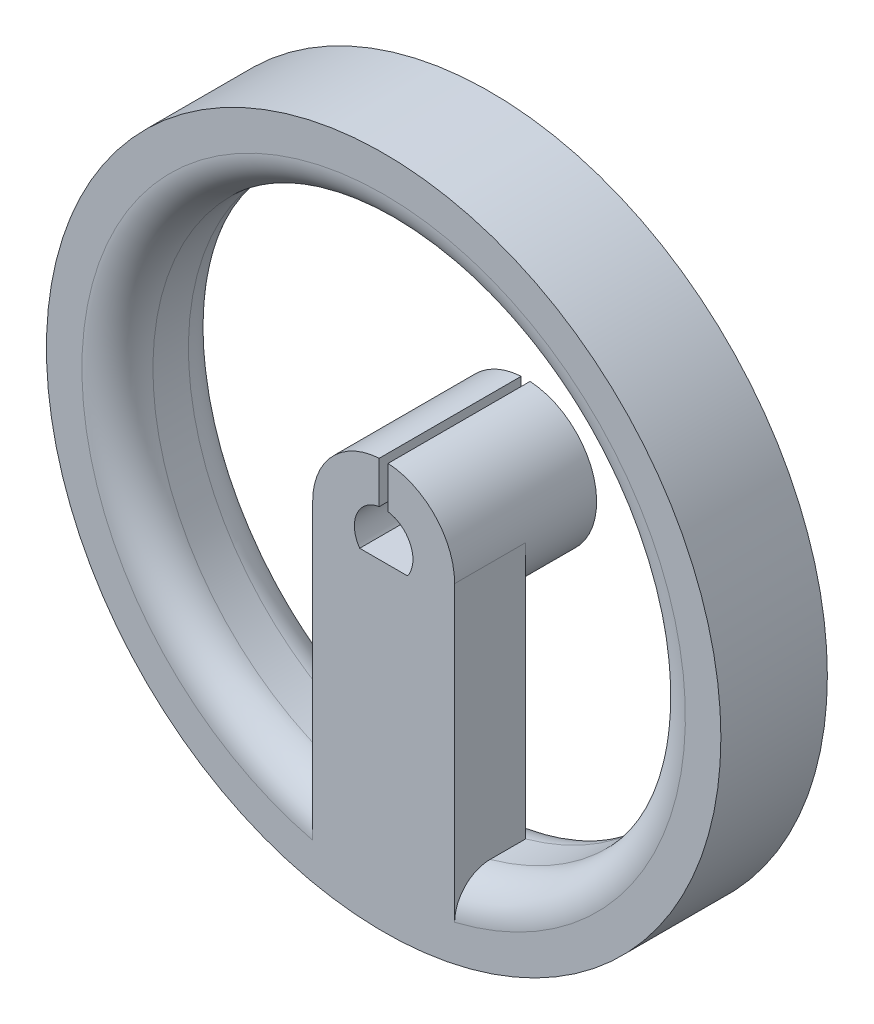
ISO-10303-21;
HEADER;
FILE_DESCRIPTION(('STEP AP214'),'2;1');
FILE_NAME('part.step','',(''),(''),'','','');
FILE_SCHEMA(('AUTOMOTIVE_DESIGN { 1 0 10303 214 1 1 1 1 }'));
ENDSEC;
DATA;
#1=APPLICATION_CONTEXT('core data for automotive mechanical design processes');
#2=APPLICATION_PROTOCOL_DEFINITION('international standard','automotive_design',2000,#1);
#3=PRODUCT_CONTEXT('',#1,'mechanical');
#4=PRODUCT('Part','Part','',(#3));
#5=PRODUCT_RELATED_PRODUCT_CATEGORY('part','',(#4));
#6=PRODUCT_DEFINITION_FORMATION('','',#4);
#7=PRODUCT_DEFINITION_CONTEXT('part definition',#1,'design');
#8=PRODUCT_DEFINITION('design','',#6,#7);
#9=PRODUCT_DEFINITION_SHAPE('','',#8);
#10=(LENGTH_UNIT() NAMED_UNIT(*) SI_UNIT(.MILLI.,.METRE.));
#11=(NAMED_UNIT(*) PLANE_ANGLE_UNIT() SI_UNIT($,.RADIAN.));
#12=(NAMED_UNIT(*) SI_UNIT($,.STERADIAN.) SOLID_ANGLE_UNIT());
#13=UNCERTAINTY_MEASURE_WITH_UNIT(LENGTH_MEASURE(1.E-05),#10,'distance_accuracy_value','');
#14=(GEOMETRIC_REPRESENTATION_CONTEXT(3) GLOBAL_UNCERTAINTY_ASSIGNED_CONTEXT((#13)) GLOBAL_UNIT_ASSIGNED_CONTEXT((#10,
#11,#12)) REPRESENTATION_CONTEXT('',''));
#15=CARTESIAN_POINT('',(0.,0.,0.));
#16=DIRECTION('',(0.,0.,1.));
#17=DIRECTION('',(1.,0.,0.));
#18=AXIS2_PLACEMENT_3D('',#15,#16,#17);
#19=CARTESIAN_POINT('',(0.,0.,-2.));
#20=DIRECTION('',(0.,0.,1.));
#21=DIRECTION('',(1.,0.,0.));
#22=AXIS2_PLACEMENT_3D('',#19,#20,#21);
#23=CYLINDRICAL_SURFACE('',#22,1.65);
#24=DIRECTION('',(0.,0.,1.));
#25=VECTOR('',#24,1.);
#26=CARTESIAN_POINT('',(0.25,1.63095064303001,-2.));
#27=LINE('',#26,#25);
#28=CARTESIAN_POINT('',(0.25,1.63095064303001,-2.));
#29=VERTEX_POINT('',#28);
#30=CARTESIAN_POINT('',(0.25,1.63095064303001,6.));
#31=VERTEX_POINT('',#30);
#32=EDGE_CURVE('E12',#29,#31,#27,.T.);
#33=ORIENTED_EDGE('',*,*,#32,.F.);
#34=CARTESIAN_POINT('',(0.,0.,-2.));
#35=DIRECTION('',(0.,0.,-1.));
#36=DIRECTION('',(1.,0.,0.));
#37=AXIS2_PLACEMENT_3D('',#34,#35,#36);
#38=CIRCLE('',#37,1.65);
#39=CARTESIAN_POINT('',(1.3490737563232,-0.95,-2.));
#40=VERTEX_POINT('',#39);
#41=EDGE_CURVE('E141',#29,#40,#38,.T.);
#42=ORIENTED_EDGE('',*,*,#41,.T.);
#43=DIRECTION('',(0.,0.,1.));
#44=VECTOR('',#43,1.);
#45=CARTESIAN_POINT('',(1.3490737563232,-0.95,-2.));
#46=LINE('',#45,#44);
#47=CARTESIAN_POINT('',(1.3490737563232,-0.95,6.));
#48=VERTEX_POINT('',#47);
#49=EDGE_CURVE('E149',#40,#48,#46,.T.);
#50=ORIENTED_EDGE('',*,*,#49,.T.);
#51=CARTESIAN_POINT('',(0.,0.,6.));
#52=DIRECTION('',(0.,0.,1.));
#53=DIRECTION('',(1.,0.,0.));
#54=AXIS2_PLACEMENT_3D('',#51,#52,#53);
#55=CIRCLE('',#54,1.65);
#56=EDGE_CURVE('E155',#31,#48,#55,.F.);
#57=ORIENTED_EDGE('',*,*,#56,.F.);
#58=EDGE_LOOP('',(#33,#42,#50,#57));
#59=FACE_BOUND('',#58,.T.);
#60=ADVANCED_FACE('F37',(#59),#23,.F.);
#61=CARTESIAN_POINT('',(0.,0.,6.));
#62=DIRECTION('',(0.,0.,1.));
#63=DIRECTION('',(1.,0.,0.));
#64=AXIS2_PLACEMENT_3D('',#61,#62,#63);
#65=PLANE('',#64);
#66=DIRECTION('',(0.,1.,0.));
#67=VECTOR('',#66,1.);
#68=CARTESIAN_POINT('',(0.250000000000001,0.,6.));
#69=LINE('',#68,#67);
#70=CARTESIAN_POINT('',(0.25,3.99217985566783,6.));
#71=VERTEX_POINT('',#70);
#72=EDGE_CURVE('E144',#31,#71,#69,.T.);
#73=ORIENTED_EDGE('',*,*,#72,.F.);
#74=ORIENTED_EDGE('',*,*,#56,.T.);
#75=DIRECTION('',(-1.,0.,0.));
#76=VECTOR('',#75,1.);
#77=CARTESIAN_POINT('',(0.,-0.95,6.));
#78=LINE('',#77,#76);
#79=CARTESIAN_POINT('',(-1.3490737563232,-0.95,6.));
#80=VERTEX_POINT('',#79);
#81=EDGE_CURVE('E152',#48,#80,#78,.T.);
#82=ORIENTED_EDGE('',*,*,#81,.T.);
#83=CARTESIAN_POINT('',(-0.25,1.63095064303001,6.));
#84=VERTEX_POINT('',#83);
#85=EDGE_CURVE('E156',#80,#84,#55,.F.);
#86=ORIENTED_EDGE('',*,*,#85,.T.);
#87=DIRECTION('',(0.,-1.,0.));
#88=VECTOR('',#87,1.);
#89=CARTESIAN_POINT('',(-0.250000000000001,0.,6.));
#90=LINE('',#89,#88);
#91=CARTESIAN_POINT('',(-0.25,3.99217985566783,6.));
#92=VERTEX_POINT('',#91);
#93=EDGE_CURVE('E53',#92,#84,#90,.T.);
#94=ORIENTED_EDGE('',*,*,#93,.F.);
#95=CARTESIAN_POINT('',(0.,0.,6.));
#96=DIRECTION('',(0.,0.,1.));
#97=DIRECTION('',(1.,0.,0.));
#98=AXIS2_PLACEMENT_3D('',#95,#96,#97);
#99=CIRCLE('',#98,4.);
#100=CARTESIAN_POINT('',(-4.,-7.21671059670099E-08,6.));
#101=VERTEX_POINT('',#100);
#102=EDGE_CURVE('E159',#92,#101,#99,.T.);
#103=ORIENTED_EDGE('',*,*,#102,.T.);
#104=DIRECTION('',(0.,-1.,0.));
#105=VECTOR('',#104,1.);
#106=CARTESIAN_POINT('',(-4.,-7.21671059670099E-08,6.));
#107=LINE('',#106,#105);
#108=CARTESIAN_POINT('',(-4.,-16.5227116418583,6.));
#109=VERTEX_POINT('',#108);
#110=EDGE_CURVE('E174',#101,#109,#107,.T.);
#111=ORIENTED_EDGE('',*,*,#110,.T.);
#112=CARTESIAN_POINT('',(0.,0.,6.));
#113=DIRECTION('',(0.,0.,1.));
#114=DIRECTION('',(1.,0.,0.));
#115=AXIS2_PLACEMENT_3D('',#112,#113,#114);
#116=CIRCLE('',#115,17.);
#117=CARTESIAN_POINT('',(4.,-16.5227116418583,6.));
#118=VERTEX_POINT('',#117);
#119=EDGE_CURVE('E203',#109,#118,#116,.F.);
#120=ORIENTED_EDGE('',*,*,#119,.T.);
#121=DIRECTION('',(0.,1.,0.));
#122=VECTOR('',#121,1.);
#123=CARTESIAN_POINT('',(4.,-14.456832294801,6.));
#124=LINE('',#123,#122);
#125=CARTESIAN_POINT('',(4.,-7.21671060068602E-08,6.));
#126=VERTEX_POINT('',#125);
#127=EDGE_CURVE('E164',#118,#126,#124,.T.);
#128=ORIENTED_EDGE('',*,*,#127,.T.);
#129=EDGE_CURVE('E171',#126,#71,#99,.T.);
#130=ORIENTED_EDGE('',*,*,#129,.T.);
#131=EDGE_LOOP('',(#73,#74,#82,#86,#94,#103,#111,#120,#128,#130));
#132=FACE_BOUND('',#131,.T.);
#133=CARTESIAN_POINT('',(0.,0.,6.));
#134=DIRECTION('',(0.,0.,1.));
#135=DIRECTION('',(1.,0.,0.));
#136=AXIS2_PLACEMENT_3D('',#133,#134,#135);
#137=CIRCLE('',#136,19.);
#138=CARTESIAN_POINT('',(19.,0.,6.));
#139=VERTEX_POINT('',#138);
#140=EDGE_CURVE('E189',#139,#139,#137,.T.);
#141=ORIENTED_EDGE('',*,*,#140,.T.);
#142=EDGE_LOOP('',(#141));
#143=FACE_BOUND('',#142,.T.);
#144=ADVANCED_FACE('F237',(#132,#143),#65,.T.);
#145=CARTESIAN_POINT('',(0.,0.,-2.));
#146=DIRECTION('',(0.,0.,1.));
#147=DIRECTION('',(1.,0.,0.));
#148=AXIS2_PLACEMENT_3D('',#145,#146,#147);
#149=PLANE('',#148);
#150=ORIENTED_EDGE('',*,*,#41,.F.);
#151=DIRECTION('',(0.,-1.,0.));
#152=VECTOR('',#151,1.);
#153=CARTESIAN_POINT('',(0.25,4.56774334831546,-2.));
#154=LINE('',#153,#152);
#155=CARTESIAN_POINT('',(0.25,3.99217985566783,-2.));
#156=VERTEX_POINT('',#155);
#157=EDGE_CURVE('E60',#156,#29,#154,.T.);
#158=ORIENTED_EDGE('',*,*,#157,.F.);
#159=CARTESIAN_POINT('',(0.,0.,-2.));
#160=DIRECTION('',(0.,0.,1.));
#161=DIRECTION('',(1.,0.,0.));
#162=AXIS2_PLACEMENT_3D('',#159,#160,#161);
#163=CIRCLE('',#162,4.00000000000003);
#164=CARTESIAN_POINT('',(-0.25,3.99217985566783,-2.));
#165=VERTEX_POINT('',#164);
#166=EDGE_CURVE('E134',#165,#156,#163,.T.);
#167=ORIENTED_EDGE('',*,*,#166,.F.);
#168=DIRECTION('',(0.,1.,0.));
#169=VECTOR('',#168,1.);
#170=CARTESIAN_POINT('',(-0.25,4.56774334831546,-2.));
#171=LINE('',#170,#169);
#172=CARTESIAN_POINT('',(-0.25,1.63095064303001,-2.));
#173=VERTEX_POINT('',#172);
#174=EDGE_CURVE('E119',#173,#165,#171,.T.);
#175=ORIENTED_EDGE('',*,*,#174,.F.);
#176=CARTESIAN_POINT('',(-1.3490737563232,-0.95,-2.));
#177=VERTEX_POINT('',#176);
#178=EDGE_CURVE('E132',#177,#173,#38,.T.);
#179=ORIENTED_EDGE('',*,*,#178,.F.);
#180=DIRECTION('',(-1.,0.,0.));
#181=VECTOR('',#180,1.);
#182=CARTESIAN_POINT('',(0.25,-0.95,-2.));
#183=LINE('',#182,#181);
#184=EDGE_CURVE('E140',#40,#177,#183,.T.);
#185=ORIENTED_EDGE('',*,*,#184,.F.);
#186=EDGE_LOOP('',(#150,#158,#167,#175,#179,#185));
#187=FACE_BOUND('',#186,.T.);
#188=ADVANCED_FACE('F130',(#187),#149,.F.);
#189=CARTESIAN_POINT('',(0.,0.,2.));
#190=DIRECTION('',(0.,0.,1.));
#191=DIRECTION('',(1.,0.,0.));
#192=AXIS2_PLACEMENT_3D('',#189,#190,#191);
#193=PLANE('',#192);
#194=CARTESIAN_POINT('',(0.,0.,2.));
#195=DIRECTION('',(0.,0.,1.));
#196=DIRECTION('',(1.,0.,0.));
#197=AXIS2_PLACEMENT_3D('',#194,#195,#196);
#198=CIRCLE('',#197,4.00000000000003);
#199=CARTESIAN_POINT('',(4.00000000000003,0.,2.));
#200=VERTEX_POINT('',#199);
#201=CARTESIAN_POINT('',(-4.,-7.21671059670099E-08,2.));
#202=VERTEX_POINT('',#201);
#203=EDGE_CURVE('E192',#200,#202,#198,.F.);
#204=ORIENTED_EDGE('',*,*,#203,.F.);
#205=DIRECTION('',(0.,1.,0.));
#206=VECTOR('',#205,1.);
#207=CARTESIAN_POINT('',(4.,-14.456832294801,2.));
#208=LINE('',#207,#206);
#209=CARTESIAN_POINT('',(4.,-14.456832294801,2.));
#210=VERTEX_POINT('',#209);
#211=EDGE_CURVE('E167',#210,#200,#208,.T.);
#212=ORIENTED_EDGE('',*,*,#211,.F.);
#213=CARTESIAN_POINT('',(0.,0.,2.));
#214=DIRECTION('',(0.,0.,1.));
#215=DIRECTION('',(-1.,0.,0.));
#216=AXIS2_PLACEMENT_3D('',#213,#214,#215);
#217=CIRCLE('',#216,15.);
#218=CARTESIAN_POINT('',(-4.,-14.456832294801,2.));
#219=VERTEX_POINT('',#218);
#220=EDGE_CURVE('E163',#219,#210,#217,.T.);
#221=ORIENTED_EDGE('',*,*,#220,.F.);
#222=DIRECTION('',(0.,-1.,0.));
#223=VECTOR('',#222,1.);
#224=CARTESIAN_POINT('',(-4.,-7.21671059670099E-08,2.));
#225=LINE('',#224,#223);
#226=EDGE_CURVE('E160',#202,#219,#225,.T.);
#227=ORIENTED_EDGE('',*,*,#226,.F.);
#228=EDGE_LOOP('',(#204,#212,#221,#227));
#229=FACE_BOUND('',#228,.T.);
#230=ADVANCED_FACE('F223',(#229),#193,.F.);
#231=CARTESIAN_POINT('',(0.,0.,6.));
#232=DIRECTION('',(0.,0.,-1.));
#233=DIRECTION('',(-1.,0.,0.));
#234=AXIS2_PLACEMENT_3D('',#231,#232,#233);
#235=CYLINDRICAL_SURFACE('',#234,19.);
#236=ORIENTED_EDGE('',*,*,#140,.F.);
#237=EDGE_LOOP('',(#236));
#238=FACE_BOUND('',#237,.T.);
#239=CARTESIAN_POINT('',(0.,0.,0.));
#240=DIRECTION('',(0.,0.,1.));
#241=DIRECTION('',(1.,0.,0.));
#242=AXIS2_PLACEMENT_3D('',#239,#240,#241);
#243=CIRCLE('',#242,19.);
#244=CARTESIAN_POINT('',(19.,0.,0.));
#245=VERTEX_POINT('',#244);
#246=EDGE_CURVE('E180',#245,#245,#243,.T.);
#247=ORIENTED_EDGE('',*,*,#246,.T.);
#248=EDGE_LOOP('',(#247));
#249=FACE_BOUND('',#248,.T.);
#250=ADVANCED_FACE('F243',(#238,#249),#235,.T.);
#251=CARTESIAN_POINT('',(0.,0.,0.));
#252=DIRECTION('',(0.,0.,1.));
#253=DIRECTION('',(1.,0.,0.));
#254=AXIS2_PLACEMENT_3D('',#251,#252,#253);
#255=PLANE('',#254);
#256=CARTESIAN_POINT('',(0.,0.,0.));
#257=DIRECTION('',(0.,0.,1.));
#258=DIRECTION('',(1.,0.,0.));
#259=AXIS2_PLACEMENT_3D('',#256,#257,#258);
#260=CIRCLE('',#259,17.);
#261=CARTESIAN_POINT('',(17.,0.,0.));
#262=VERTEX_POINT('',#261);
#263=EDGE_CURVE('E200',#262,#262,#260,.T.);
#264=ORIENTED_EDGE('',*,*,#263,.T.);
#265=EDGE_LOOP('',(#264));
#266=FACE_BOUND('',#265,.T.);
#267=ORIENTED_EDGE('',*,*,#246,.F.);
#268=EDGE_LOOP('',(#267));
#269=FACE_BOUND('',#268,.T.);
#270=ADVANCED_FACE('F235',(#266,#269),#255,.F.);
#271=CARTESIAN_POINT('',(0.,0.,6.));
#272=DIRECTION('',(0.,0.,-1.));
#273=DIRECTION('',(-1.,0.,0.));
#274=AXIS2_PLACEMENT_3D('',#271,#272,#273);
#275=CYLINDRICAL_SURFACE('',#274,15.);
#276=DIRECTION('',(0.,0.,1.));
#277=VECTOR('',#276,1.);
#278=CARTESIAN_POINT('',(-4.,-14.456832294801,2.));
#279=LINE('',#278,#277);
#280=CARTESIAN_POINT('',(-4.,-14.456832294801,4.));
#281=VERTEX_POINT('',#280);
#282=EDGE_CURVE('E184',#219,#281,#279,.T.);
#283=ORIENTED_EDGE('',*,*,#282,.F.);
#284=CARTESIAN_POINT('',(0.,0.,2.));
#285=DIRECTION('',(0.,0.,1.));
#286=DIRECTION('',(1.,0.,0.));
#287=AXIS2_PLACEMENT_3D('',#284,#285,#286);
#288=CIRCLE('',#287,15.);
#289=EDGE_CURVE('E198',#219,#210,#288,.F.);
#290=ORIENTED_EDGE('',*,*,#289,.T.);
#291=DIRECTION('',(0.,0.,1.));
#292=VECTOR('',#291,1.);
#293=CARTESIAN_POINT('',(4.,-14.456832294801,2.));
#294=LINE('',#293,#292);
#295=CARTESIAN_POINT('',(4.,-14.456832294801,4.));
#296=VERTEX_POINT('',#295);
#297=EDGE_CURVE('E181',#210,#296,#294,.T.);
#298=ORIENTED_EDGE('',*,*,#297,.T.);
#299=CARTESIAN_POINT('',(0.,0.,4.));
#300=DIRECTION('',(0.,0.,1.));
#301=DIRECTION('',(1.,0.,0.));
#302=AXIS2_PLACEMENT_3D('',#299,#300,#301);
#303=CIRCLE('',#302,15.);
#304=EDGE_CURVE('E196',#296,#281,#303,.T.);
#305=ORIENTED_EDGE('',*,*,#304,.T.);
#306=EDGE_LOOP('',(#283,#290,#298,#305));
#307=FACE_BOUND('',#306,.T.);
#308=ADVANCED_FACE('F231',(#307),#275,.F.);
#309=CARTESIAN_POINT('',(0.,0.,2.));
#310=DIRECTION('',(0.,0.,1.));
#311=DIRECTION('',(1.,0.,0.));
#312=AXIS2_PLACEMENT_3D('',#309,#310,#311);
#313=CYLINDRICAL_SURFACE('',#312,4.);
#314=DIRECTION('',(0.,0.,1.));
#315=VECTOR('',#314,1.);
#316=CARTESIAN_POINT('',(0.25,3.99217985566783,2.));
#317=LINE('',#316,#315);
#318=EDGE_CURVE('E374',#71,#156,#317,.F.);
#319=ORIENTED_EDGE('',*,*,#318,.F.);
#320=ORIENTED_EDGE('',*,*,#129,.F.);
#321=DIRECTION('',(0.,0.,1.));
#322=VECTOR('',#321,1.);
#323=CARTESIAN_POINT('',(4.,-7.21671060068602E-08,2.));
#324=LINE('',#323,#322);
#325=EDGE_CURVE('E178',#200,#126,#324,.T.);
#326=ORIENTED_EDGE('',*,*,#325,.F.);
#327=ORIENTED_EDGE('',*,*,#203,.T.);
#328=DIRECTION('',(0.,0.,1.));
#329=VECTOR('',#328,1.);
#330=CARTESIAN_POINT('',(-4.,-7.21671059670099E-08,2.));
#331=LINE('',#330,#329);
#332=EDGE_CURVE('E170',#202,#101,#331,.T.);
#333=ORIENTED_EDGE('',*,*,#332,.T.);
#334=ORIENTED_EDGE('',*,*,#102,.F.);
#335=DIRECTION('',(0.,0.,1.));
#336=VECTOR('',#335,1.);
#337=CARTESIAN_POINT('',(-0.25,3.99217985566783,2.));
#338=LINE('',#337,#336);
#339=EDGE_CURVE('E135',#165,#92,#338,.T.);
#340=ORIENTED_EDGE('',*,*,#339,.F.);
#341=ORIENTED_EDGE('',*,*,#166,.T.);
#342=EDGE_LOOP('',(#319,#320,#326,#327,#333,#334,#340,#341));
#343=FACE_BOUND('',#342,.T.);
#344=ADVANCED_FACE('F221',(#343),#313,.T.);
#345=CARTESIAN_POINT('',(4.,-14.456832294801,2.));
#346=DIRECTION('',(1.,0.,0.));
#347=DIRECTION('',(0.,0.,-1.));
#348=AXIS2_PLACEMENT_3D('',#345,#346,#347);
#349=PLANE('',#348);
#350=ORIENTED_EDGE('',*,*,#127,.F.);
#351=CARTESIAN_POINT('',(4.,-16.5227116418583,6.));
#352=CARTESIAN_POINT('',(4.,-16.4632875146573,5.99999875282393));
#353=CARTESIAN_POINT('',(4.,-16.403892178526,5.99749675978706));
#354=CARTESIAN_POINT('',(4.,-16.2855222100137,5.98751850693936));
#355=CARTESIAN_POINT('',(4.,-16.2265475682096,5.98004235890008));
#356=CARTESIAN_POINT('',(4.,-16.0509058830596,5.9502121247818));
#357=CARTESIAN_POINT('',(4.,-15.9354075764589,5.92045613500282));
#358=CARTESIAN_POINT('',(4.,-15.7110349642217,5.84195239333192));
#359=CARTESIAN_POINT('',(4.,-15.6021647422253,5.79319306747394));
#360=CARTESIAN_POINT('',(4.,-15.3942828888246,5.67791305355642));
#361=CARTESIAN_POINT('',(4.,-15.2952680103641,5.61139824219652));
#362=CARTESIAN_POINT('',(4.,-15.1111325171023,5.46310253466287));
#363=CARTESIAN_POINT('',(4.,-15.0258763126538,5.38149013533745));
#364=CARTESIAN_POINT('',(4.,-14.8707706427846,5.20469095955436));
#365=CARTESIAN_POINT('',(4.,-14.8009226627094,5.10950287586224));
#366=CARTESIAN_POINT('',(4.,-14.6809400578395,4.91131357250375));
#367=CARTESIAN_POINT('',(4.,-14.6302785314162,4.80863099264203));
#368=CARTESIAN_POINT('',(4.,-14.5476296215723,4.59605947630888));
#369=CARTESIAN_POINT('',(4.,-14.5156213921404,4.4861787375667));
#370=CARTESIAN_POINT('',(4.,-14.4813242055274,4.31276831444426));
#371=CARTESIAN_POINT('',(4.,-14.4721451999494,4.25052656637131));
#372=CARTESIAN_POINT('',(4.,-14.4599015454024,4.12553386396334));
#373=CARTESIAN_POINT('',(4.,-14.4568282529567,4.06278375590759));
#374=CARTESIAN_POINT('',(4.,-14.456832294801,4.));
#375=B_SPLINE_CURVE_WITH_KNOTS('',3,(#351,#352,#353,#354,#355,#356,#357,#358,#359,#360,#361,
#362,#363,#364,#365,#366,#367,#368,#369,#370,#371,#372,#373,#374),.UNSPECIFIED.,.F.,.F.,(4,2,2,
2,2,2,2,2,2,2,2,4),(0.,0.178162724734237,0.356321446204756,0.712302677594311,1.06850105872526,
1.42458169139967,1.77690489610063,2.12926204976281,2.47108560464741,2.81252641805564,
3.00100368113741,3.18921393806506),.UNSPECIFIED.);
#376=EDGE_CURVE('E206',#118,#296,#375,.T.);
#377=ORIENTED_EDGE('',*,*,#376,.T.);
#378=ORIENTED_EDGE('',*,*,#297,.F.);
#379=ORIENTED_EDGE('',*,*,#211,.T.);
#380=ORIENTED_EDGE('',*,*,#325,.T.);
#381=EDGE_LOOP('',(#350,#377,#378,#379,#380));
#382=FACE_BOUND('',#381,.T.);
#383=ADVANCED_FACE('F216',(#382),#349,.T.);
#384=CARTESIAN_POINT('',(-4.,-7.21671059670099E-08,2.));
#385=DIRECTION('',(-1.,0.,0.));
#386=DIRECTION('',(0.,0.,1.));
#387=AXIS2_PLACEMENT_3D('',#384,#385,#386);
#388=PLANE('',#387);
#389=ORIENTED_EDGE('',*,*,#110,.F.);
#390=ORIENTED_EDGE('',*,*,#332,.F.);
#391=ORIENTED_EDGE('',*,*,#226,.T.);
#392=ORIENTED_EDGE('',*,*,#282,.T.);
#393=CARTESIAN_POINT('',(-4.,-14.456832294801,4.));
#394=CARTESIAN_POINT('',(-4.,-14.456831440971,4.05485196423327));
#395=CARTESIAN_POINT('',(-4.,-14.4591751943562,4.1096770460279));
#396=CARTESIAN_POINT('',(-4.,-14.4685171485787,4.21892211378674));
#397=CARTESIAN_POINT('',(-4.,-14.4755147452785,4.27334215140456));
#398=CARTESIAN_POINT('',(-4.,-14.5033865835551,4.43519599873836));
#399=CARTESIAN_POINT('',(-4.,-14.5311403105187,4.54152483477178));
#400=CARTESIAN_POINT('',(-4.,-14.6040403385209,4.74797697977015));
#401=CARTESIAN_POINT('',(-4.,-14.6491880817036,4.84809977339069));
#402=CARTESIAN_POINT('',(-4.,-14.7553838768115,5.03953859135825));
#403=CARTESIAN_POINT('',(-4.,-14.8164341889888,5.13085336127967));
#404=CARTESIAN_POINT('',(-4.,-14.9536749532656,5.30379040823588));
#405=CARTESIAN_POINT('',(-4.,-15.0301017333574,5.38522485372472));
#406=CARTESIAN_POINT('',(-4.,-15.1951566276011,5.53462940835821));
#407=CARTESIAN_POINT('',(-4.,-15.2837879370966,5.6025959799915));
#408=CARTESIAN_POINT('',(-4.,-15.4739128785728,5.72551843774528));
#409=CARTESIAN_POINT('',(-4.,-15.5757387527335,5.77996010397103));
#410=CARTESIAN_POINT('',(-4.,-15.7869069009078,5.87147118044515));
#411=CARTESIAN_POINT('',(-4.,-15.8962475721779,5.9085442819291));
#412=CARTESIAN_POINT('',(-4.,-16.0919773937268,5.95757610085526));
#413=CARTESIAN_POINT('',(-4.,-16.1774047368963,5.97346743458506));
#414=CARTESIAN_POINT('',(-4.,-16.3494489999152,5.99468044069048));
#415=CARTESIAN_POINT('',(-4.,-16.4360642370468,6.00001576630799));
#416=CARTESIAN_POINT('',(-4.,-16.5227116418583,6.));
#417=B_SPLINE_CURVE_WITH_KNOTS('',3,(#393,#394,#395,#396,#397,#398,#399,#400,#401,#402,#403,
#404,#405,#406,#407,#408,#409,#410,#411,#412,#413,#414,#415,#416),.UNSPECIFIED.,.F.,.F.,(4,2,2,
2,2,2,2,2,2,2,2,4),(0.,0.164452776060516,0.328884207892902,0.656854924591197,0.984852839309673,
1.31289739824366,1.64643317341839,1.98005644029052,2.32489569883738,2.66966163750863,
2.92971562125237,3.18943302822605),.UNSPECIFIED.);
#418=EDGE_CURVE('E125',#281,#109,#417,.T.);
#419=ORIENTED_EDGE('',*,*,#418,.T.);
#420=EDGE_LOOP('',(#389,#390,#391,#392,#419));
#421=FACE_BOUND('',#420,.T.);
#422=ADVANCED_FACE('F220',(#421),#388,.T.);
#423=DIRECTION('',(0.,0.,1.));
#424=VECTOR('',#423,1.);
#425=CARTESIAN_POINT('',(-0.25,1.63095064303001,-2.));
#426=LINE('',#425,#424);
#427=EDGE_CURVE('E46',#84,#173,#426,.F.);
#428=ORIENTED_EDGE('',*,*,#427,.F.);
#429=ORIENTED_EDGE('',*,*,#85,.F.);
#430=DIRECTION('',(0.,0.,1.));
#431=VECTOR('',#430,1.);
#432=CARTESIAN_POINT('',(-1.3490737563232,-0.95,-2.));
#433=LINE('',#432,#431);
#434=EDGE_CURVE('E139',#177,#80,#433,.T.);
#435=ORIENTED_EDGE('',*,*,#434,.F.);
#436=ORIENTED_EDGE('',*,*,#178,.T.);
#437=EDGE_LOOP('',(#428,#429,#435,#436));
#438=FACE_BOUND('',#437,.T.);
#439=ADVANCED_FACE('F138',(#438),#23,.F.);
#440=CARTESIAN_POINT('',(-1.3490737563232,-0.95,-2.));
#441=DIRECTION('',(0.,1.,0.));
#442=DIRECTION('',(0.,0.,1.));
#443=AXIS2_PLACEMENT_3D('',#440,#441,#442);
#444=PLANE('',#443);
#445=ORIENTED_EDGE('',*,*,#49,.F.);
#446=ORIENTED_EDGE('',*,*,#184,.T.);
#447=ORIENTED_EDGE('',*,*,#434,.T.);
#448=ORIENTED_EDGE('',*,*,#81,.F.);
#449=EDGE_LOOP('',(#445,#446,#447,#448));
#450=FACE_BOUND('',#449,.T.);
#451=ADVANCED_FACE('F249',(#450),#444,.T.);
#452=CARTESIAN_POINT('',(0.,0.,2.));
#453=DIRECTION('',(0.,0.,1.));
#454=DIRECTION('',(1.,0.,0.));
#455=AXIS2_PLACEMENT_3D('',#452,#453,#454);
#456=TOROIDAL_SURFACE('',#455,17.,2.);
#457=ORIENTED_EDGE('',*,*,#263,.F.);
#458=EDGE_LOOP('',(#457));
#459=FACE_BOUND('',#458,.T.);
#460=ORIENTED_EDGE('',*,*,#289,.F.);
#461=ORIENTED_EDGE('',*,*,#220,.T.);
#462=EDGE_LOOP('',(#460,#461));
#463=FACE_BOUND('',#462,.T.);
#464=ADVANCED_FACE('F247',(#459,#463),#456,.T.);
#465=CARTESIAN_POINT('',(0.,0.,4.));
#466=DIRECTION('',(0.,0.,1.));
#467=DIRECTION('',(1.,0.,0.));
#468=AXIS2_PLACEMENT_3D('',#465,#466,#467);
#469=TOROIDAL_SURFACE('',#468,17.,2.);
#470=ORIENTED_EDGE('',*,*,#418,.F.);
#471=ORIENTED_EDGE('',*,*,#304,.F.);
#472=ORIENTED_EDGE('',*,*,#376,.F.);
#473=ORIENTED_EDGE('',*,*,#119,.F.);
#474=EDGE_LOOP('',(#470,#471,#472,#473));
#475=FACE_BOUND('',#474,.T.);
#476=ADVANCED_FACE('F39',(#475),#469,.T.);
#477=CARTESIAN_POINT('',(-0.25,4.56774334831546,6.12240496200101));
#478=DIRECTION('',(-1.,0.,0.));
#479=DIRECTION('',(0.,-1.,0.));
#480=AXIS2_PLACEMENT_3D('',#477,#478,#479);
#481=PLANE('',#480);
#482=ORIENTED_EDGE('',*,*,#93,.T.);
#483=ORIENTED_EDGE('',*,*,#427,.T.);
#484=ORIENTED_EDGE('',*,*,#174,.T.);
#485=ORIENTED_EDGE('',*,*,#339,.T.);
#486=EDGE_LOOP('',(#482,#483,#484,#485));
#487=FACE_BOUND('',#486,.T.);
#488=ADVANCED_FACE('F118',(#487),#481,.F.);
#489=CARTESIAN_POINT('',(0.25,4.56774334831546,6.12240496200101));
#490=DIRECTION('',(1.,0.,0.));
#491=DIRECTION('',(0.,1.,0.));
#492=AXIS2_PLACEMENT_3D('',#489,#490,#491);
#493=PLANE('',#492);
#494=ORIENTED_EDGE('',*,*,#72,.T.);
#495=ORIENTED_EDGE('',*,*,#318,.T.);
#496=ORIENTED_EDGE('',*,*,#157,.T.);
#497=ORIENTED_EDGE('',*,*,#32,.T.);
#498=EDGE_LOOP('',(#494,#495,#496,#497));
#499=FACE_BOUND('',#498,.T.);
#500=ADVANCED_FACE('F361',(#499),#493,.F.);
#501=CLOSED_SHELL('',(#60,#144,#188,#230,#250,#270,#308,#344,#383,#422,#439,#451,#464,#476,#488,#500));
#502=MANIFOLD_SOLID_BREP('B2',#501);
#503=ADVANCED_BREP_SHAPE_REPRESENTATION('',(#18,#502),#14);
#504=SHAPE_DEFINITION_REPRESENTATION(#9,#503);
ENDSEC;
END-ISO-10303-21;
